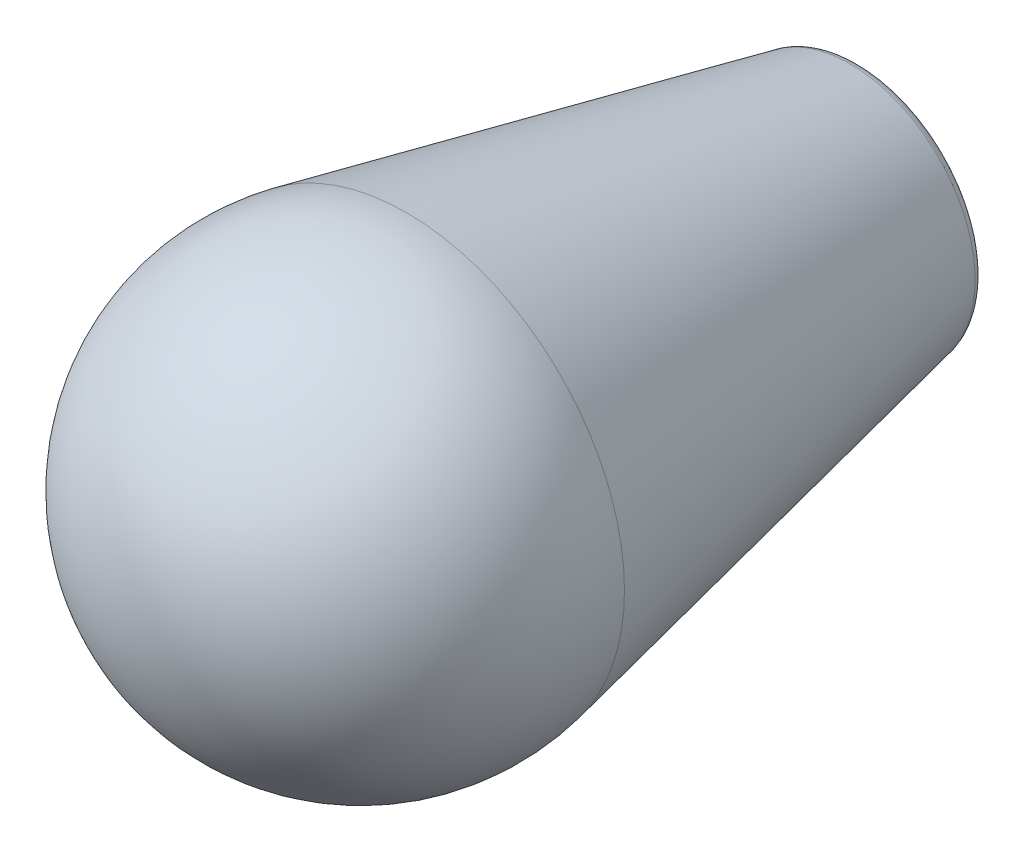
ISO-10303-21;
HEADER;
FILE_DESCRIPTION(('STEP AP214'),'2;1');
FILE_NAME('part.step','',(''),(''),'','','');
FILE_SCHEMA(('AUTOMOTIVE_DESIGN { 1 0 10303 214 1 1 1 1 }'));
ENDSEC;
DATA;
#1=APPLICATION_CONTEXT('core data for automotive mechanical design processes');
#2=APPLICATION_PROTOCOL_DEFINITION('international standard','automotive_design',2000,#1);
#3=PRODUCT_CONTEXT('',#1,'mechanical');
#4=PRODUCT('Part','Part','',(#3));
#5=PRODUCT_RELATED_PRODUCT_CATEGORY('part','',(#4));
#6=PRODUCT_DEFINITION_FORMATION('','',#4);
#7=PRODUCT_DEFINITION_CONTEXT('part definition',#1,'design');
#8=PRODUCT_DEFINITION('design','',#6,#7);
#9=PRODUCT_DEFINITION_SHAPE('','',#8);
#10=(LENGTH_UNIT() NAMED_UNIT(*) SI_UNIT(.MILLI.,.METRE.));
#11=(NAMED_UNIT(*) PLANE_ANGLE_UNIT() SI_UNIT($,.RADIAN.));
#12=(NAMED_UNIT(*) SI_UNIT($,.STERADIAN.) SOLID_ANGLE_UNIT());
#13=UNCERTAINTY_MEASURE_WITH_UNIT(LENGTH_MEASURE(1.E-05),#10,'distance_accuracy_value','');
#14=(GEOMETRIC_REPRESENTATION_CONTEXT(3) GLOBAL_UNCERTAINTY_ASSIGNED_CONTEXT((#13)) GLOBAL_UNIT_ASSIGNED_CONTEXT((#10,
#11,#12)) REPRESENTATION_CONTEXT('',''));
#15=CARTESIAN_POINT('',(0.,0.,0.));
#16=DIRECTION('',(0.,0.,1.));
#17=DIRECTION('',(1.,0.,0.));
#18=AXIS2_PLACEMENT_3D('',#15,#16,#17);
#19=CARTESIAN_POINT('',(0.,0.,32.5));
#20=DIRECTION('',(0.,0.,1.));
#21=DIRECTION('',(1.,0.,0.));
#22=AXIS2_PLACEMENT_3D('',#19,#20,#21);
#23=SPHERICAL_SURFACE('',#22,14.5);
#24=CARTESIAN_POINT('',(0.,0.,29.5240168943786));
#25=DIRECTION('',(0.,0.,1.));
#26=DIRECTION('',(-1.,0.,0.));
#27=AXIS2_PLACEMENT_3D('',#24,#25,#26);
#28=CIRCLE('',#27,14.191318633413);
#29=CARTESIAN_POINT('',(-14.191318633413,0.,29.5240168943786));
#30=VERTEX_POINT('',#29);
#31=EDGE_CURVE('E37',#30,#30,#28,.T.);
#32=ORIENTED_EDGE('',*,*,#31,.T.);
#33=EDGE_LOOP('',(#32));
#34=FACE_BOUND('',#33,.T.);
#35=ADVANCED_FACE('F12',(#34),#23,.T.);
#36=CARTESIAN_POINT('',(4.,0.,28.));
#37=DIRECTION('',(0.,0.,1.));
#38=DIRECTION('',(-1.,0.,0.));
#39=AXIS2_PLACEMENT_3D('',#36,#37,#38);
#40=PLANE('',#39);
#41=CARTESIAN_POINT('',(0.,0.,28.));
#42=DIRECTION('',(0.,0.,1.));
#43=DIRECTION('',(-1.,0.,0.));
#44=AXIS2_PLACEMENT_3D('',#41,#42,#43);
#45=CIRCLE('',#44,4.);
#46=CARTESIAN_POINT('',(-3.99999999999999,0.,28.));
#47=VERTEX_POINT('',#46);
#48=EDGE_CURVE('E8',#47,#47,#45,.T.);
#49=ORIENTED_EDGE('',*,*,#48,.F.);
#50=EDGE_LOOP('',(#49));
#51=FACE_BOUND('',#50,.T.);
#52=ADVANCED_FACE('F75',(#51),#40,.F.);
#53=CARTESIAN_POINT('',(0.,0.,47.));
#54=DIRECTION('',(0.,0.,1.));
#55=DIRECTION('',(-1.,0.,0.));
#56=AXIS2_PLACEMENT_3D('',#53,#54,#55);
#57=CYLINDRICAL_SURFACE('',#56,4.);
#58=CARTESIAN_POINT('',(0.,0.,3.5));
#59=DIRECTION('',(0.,0.,1.));
#60=DIRECTION('',(-1.,0.,0.));
#61=AXIS2_PLACEMENT_3D('',#58,#59,#60);
#62=CIRCLE('',#61,4.);
#63=CARTESIAN_POINT('',(-3.99999999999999,0.,3.5));
#64=VERTEX_POINT('',#63);
#65=EDGE_CURVE('E18',#64,#64,#62,.T.);
#66=ORIENTED_EDGE('',*,*,#65,.F.);
#67=EDGE_LOOP('',(#66));
#68=FACE_BOUND('',#67,.T.);
#69=ORIENTED_EDGE('',*,*,#48,.T.);
#70=EDGE_LOOP('',(#69));
#71=FACE_BOUND('',#70,.T.);
#72=ADVANCED_FACE('F68',(#68,#71),#57,.F.);
#73=CARTESIAN_POINT('',(4.25,0.,3.5));
#74=DIRECTION('',(0.,0.,1.));
#75=DIRECTION('',(-1.,0.,0.));
#76=AXIS2_PLACEMENT_3D('',#73,#74,#75);
#77=PLANE('',#76);
#78=CARTESIAN_POINT('',(0.,0.,3.5));
#79=DIRECTION('',(0.,0.,1.));
#80=DIRECTION('',(-1.,0.,0.));
#81=AXIS2_PLACEMENT_3D('',#78,#79,#80);
#82=CIRCLE('',#81,4.25);
#83=CARTESIAN_POINT('',(-4.24999999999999,0.,3.5));
#84=VERTEX_POINT('',#83);
#85=EDGE_CURVE('E22',#84,#84,#82,.T.);
#86=ORIENTED_EDGE('',*,*,#85,.F.);
#87=EDGE_LOOP('',(#86));
#88=FACE_BOUND('',#87,.T.);
#89=ORIENTED_EDGE('',*,*,#65,.T.);
#90=EDGE_LOOP('',(#89));
#91=FACE_BOUND('',#90,.T.);
#92=ADVANCED_FACE('F63',(#88,#91),#77,.F.);
#93=CARTESIAN_POINT('',(0.,0.,47.));
#94=DIRECTION('',(0.,0.,1.));
#95=DIRECTION('',(-1.,0.,0.));
#96=AXIS2_PLACEMENT_3D('',#93,#94,#95);
#97=CYLINDRICAL_SURFACE('',#96,4.25);
#98=CARTESIAN_POINT('',(0.,0.,0.));
#99=DIRECTION('',(0.,0.,1.));
#100=DIRECTION('',(-1.,0.,0.));
#101=AXIS2_PLACEMENT_3D('',#98,#99,#100);
#102=CIRCLE('',#101,4.25);
#103=CARTESIAN_POINT('',(-4.24999999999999,0.,0.));
#104=VERTEX_POINT('',#103);
#105=EDGE_CURVE('E26',#104,#104,#102,.T.);
#106=ORIENTED_EDGE('',*,*,#105,.F.);
#107=EDGE_LOOP('',(#106));
#108=FACE_BOUND('',#107,.T.);
#109=ORIENTED_EDGE('',*,*,#85,.T.);
#110=EDGE_LOOP('',(#109));
#111=FACE_BOUND('',#110,.T.);
#112=ADVANCED_FACE('F57',(#108,#111),#97,.F.);
#113=CARTESIAN_POINT('',(4.25,0.,0.));
#114=DIRECTION('',(0.,0.,1.));
#115=DIRECTION('',(-1.,0.,0.));
#116=AXIS2_PLACEMENT_3D('',#113,#114,#115);
#117=PLANE('',#116);
#118=CARTESIAN_POINT('',(0.,0.,0.));
#119=DIRECTION('',(0.,0.,1.));
#120=DIRECTION('',(-1.,0.,0.));
#121=AXIS2_PLACEMENT_3D('',#118,#119,#120);
#122=CIRCLE('',#121,7.35036244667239);
#123=CARTESIAN_POINT('',(-7.35036244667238,0.,0.));
#124=VERTEX_POINT('',#123);
#125=EDGE_CURVE('E31',#124,#124,#122,.T.);
#126=ORIENTED_EDGE('',*,*,#125,.F.);
#127=EDGE_LOOP('',(#126));
#128=FACE_BOUND('',#127,.T.);
#129=ORIENTED_EDGE('',*,*,#105,.T.);
#130=EDGE_LOOP('',(#129));
#131=FACE_BOUND('',#130,.T.);
#132=ADVANCED_FACE('F51',(#128,#131),#117,.F.);
#133=CARTESIAN_POINT('',(0.,0.,0.8));
#134=DIRECTION('',(0.,0.,1.));
#135=DIRECTION('',(-1.,0.,0.));
#136=AXIS2_PLACEMENT_3D('',#133,#134,#135);
#137=TOROIDAL_SURFACE('',#136,7.35036244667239,0.8);
#138=CARTESIAN_POINT('',(0.,0.,0.635807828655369));
#139=DIRECTION('',(0.,0.,1.));
#140=DIRECTION('',(-1.,0.,0.));
#141=AXIS2_PLACEMENT_3D('',#138,#139,#140);
#142=CIRCLE('',#141,8.13333175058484);
#143=CARTESIAN_POINT('',(-8.13333175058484,0.,0.635807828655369));
#144=VERTEX_POINT('',#143);
#145=EDGE_CURVE('E34',#144,#144,#142,.T.);
#146=ORIENTED_EDGE('',*,*,#145,.F.);
#147=EDGE_LOOP('',(#146));
#148=FACE_BOUND('',#147,.T.);
#149=ORIENTED_EDGE('',*,*,#125,.T.);
#150=EDGE_LOOP('',(#149));
#151=FACE_BOUND('',#150,.T.);
#152=ADVANCED_FACE('F45',(#148,#151),#137,.T.);
#153=CARTESIAN_POINT('',(0.,0.,0.635807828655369));
#154=DIRECTION('',(0.,0.,1.));
#155=DIRECTION('',(-1.,0.,0.));
#156=AXIS2_PLACEMENT_3D('',#153,#154,#155);
#157=CONICAL_SURFACE('',#156,8.13333175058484,0.20670914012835);
#158=ORIENTED_EDGE('',*,*,#31,.F.);
#159=EDGE_LOOP('',(#158));
#160=FACE_BOUND('',#159,.T.);
#161=ORIENTED_EDGE('',*,*,#145,.T.);
#162=EDGE_LOOP('',(#161));
#163=FACE_BOUND('',#162,.T.);
#164=ADVANCED_FACE('F42',(#160,#163),#157,.T.);
#165=CLOSED_SHELL('',(#35,#52,#72,#92,#112,#132,#152,#164));
#166=MANIFOLD_SOLID_BREP('B1',#165);
#167=ADVANCED_BREP_SHAPE_REPRESENTATION('',(#18,#166),#14);
#168=SHAPE_DEFINITION_REPRESENTATION(#9,#167);
ENDSEC;
END-ISO-10303-21;
